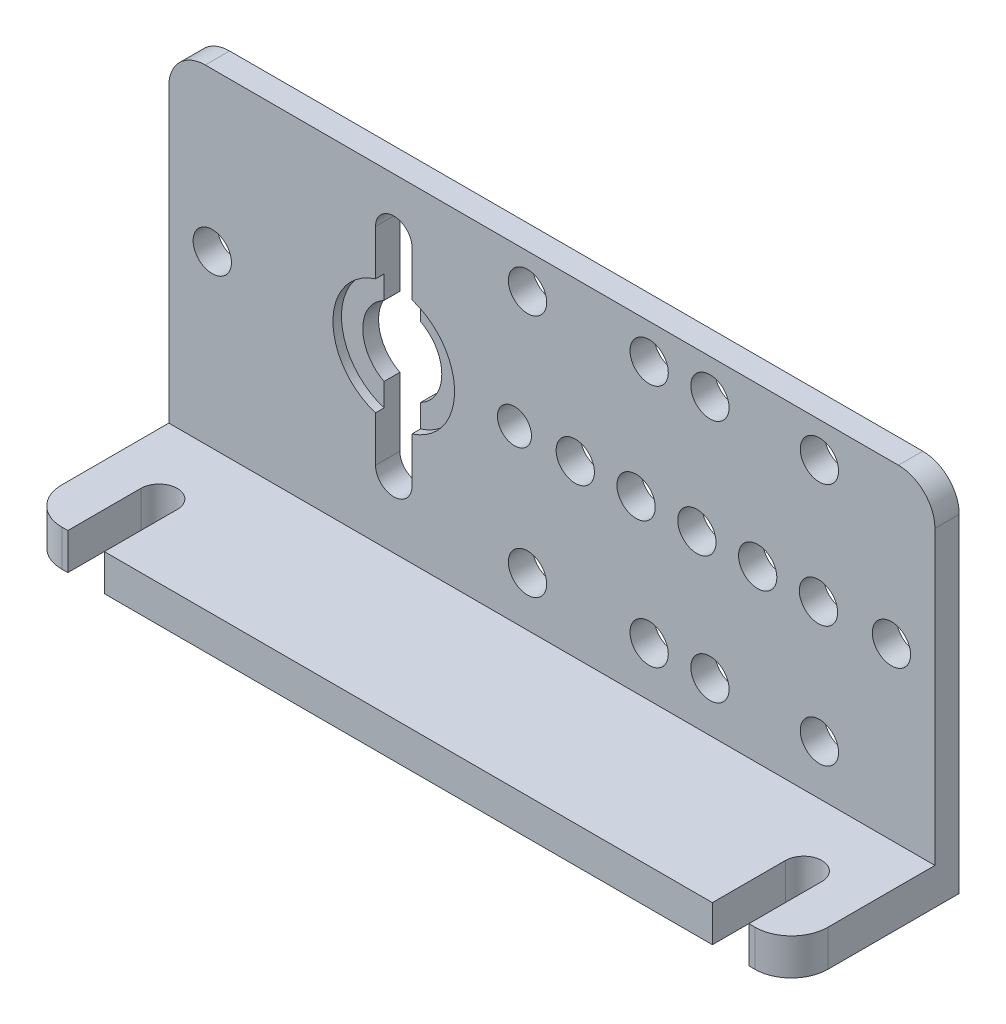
from build123d import *

# Parameters (mm, degrees)
BASE_EXTRUSION_DEPTH    = 2
BOSS_EXTRU_1_DEPTH      = 3
ENL_V_MAT_EXTRU_1_DEPTH = 71.768919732
PER_AGE3_D              = 10
PER_AGE3_DEPTH          = 0.7
ENL_V_MAT_EXTRU_3_DEPTH = 70.917379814
ENL_V_MAT_EXTRU_4_DEPTH = 70.917379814
ESQUISSE18_R            = 1.575
ESQUISSE18_R_2          = 1.4
ENL_V_MAT_EXTRU_5_DEPTH = 71.768919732


with BuildPart() as part:
    # Esquisse1 → Base-Extrusion (new body)
    with BuildSketch(Plane.XY):
        with BuildLine():
            Line((0, 0), (0, 27))
            ThreePointArc((0, 27), (0.878679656, 29.121320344), (3, 30))
            Line((3, 30), (60, 30))
            ThreePointArc((60, 30), (62.121320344, 29.121320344), (63, 27))
            Line((63, 27), (63, 0))
            Line((63, 0), (0, 0))
        make_face()
    extrude(amount=BASE_EXTRUSION_DEPTH)

    # Esquisse2 → Boss.-Extru.1 (add)
    with BuildSketch(Plane(origin=(0, 0, 0), x_dir=(1, 0, 0), z_dir=(0, 1, 0))):
        with BuildLine():
            Line((0, -2), (63, -2))
            Line((63, -2), (63, -10.8))
            ThreePointArc((63, -10.8), (62.121320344, -12.921320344), (60, -13.8))
            Line((60, -13.8), (3, -13.8))
            ThreePointArc((3, -13.8), (0.878679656, -12.921320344), (0, -10.8))
            Line((0, -10.8), (0, -2))
        make_face()
    extrude(amount=BOSS_EXTRU_1_DEPTH)

    # Esquisse5 → Enl_v. mat.-Extru.1 (cut, through all)
    with BuildSketch(Plane.XY.offset(2)):
        with BuildLine():
            Line((17, 25.5), (17, 19.883140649))
            ThreePointArc((17, 19.883140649), (15.25, 17), (17, 14.116859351))
            Line((17, 14.116859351), (17, 8.5))
            ThreePointArc((17, 8.5), (18.5, 7), (20, 8.5))
            Line((20, 8.5), (20, 14.116859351))
            ThreePointArc((20, 14.116859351), (21.75, 17), (20, 19.883140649))
            Line((20, 19.883140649), (20, 25.5))
            ThreePointArc((20, 25.5), (18.5, 27), (17, 25.5))
        make_face()
    extrude(amount=-ENL_V_MAT_EXTRU_1_DEPTH, mode=Mode.SUBTRACT)

    # Per_age3
    with Locations(Plane.XY.offset(2)):
        with Locations((18.5, 17)):
            Hole(PER_AGE3_D / 2, depth=PER_AGE3_DEPTH)

    # Esquisse12 → Enl_v. mat.-Extru.3 (cut, through all)
    with BuildSketch(Plane(origin=(0, 3, 0), x_dir=(-1, 0, 0), z_dir=(0, 1, 0))):
        with BuildLine():
            Line((-3.5, 13.8), (-3.5, 7.8))
            ThreePointArc((-3.5, 7.8), (-5, 6.3), (-6.5, 7.8))
            Line((-6.5, 7.8), (-6.5, 13.8))
            Line((-6.5, 13.8), (-3.5, 13.8))
        make_face()
    extrude(amount=-ENL_V_MAT_EXTRU_3_DEPTH, mode=Mode.SUBTRACT)

    # Esquisse13 → Enl_v. mat.-Extru.4 (cut, through all)
    with BuildSketch(Plane(origin=(0, 3, 0), x_dir=(-1, 0, 0), z_dir=(0, 1, 0))):
        with BuildLine():
            Line((-56.5, 13.8), (-59.5, 13.8))
            Line((-59.5, 13.8), (-59.5, 7.8))
            ThreePointArc((-59.5, 7.8), (-58, 6.3), (-56.5, 7.8))
            Line((-56.5, 7.8), (-56.5, 13.8))
        make_face()
    extrude(amount=-ENL_V_MAT_EXTRU_4_DEPTH, mode=Mode.SUBTRACT)

    # Esquisse18 → Enl_v. mat.-Extru.5 (cut, through all)
    with BuildSketch(Plane.XY.offset(2)):
        with Locations((3.575, 17)):
            Circle(ESQUISSE18_R)
        with Locations((28.425, 17)):
            Circle(ESQUISSE18_R_2)
        with Locations((33.425, 17)):
            Circle(ESQUISSE18_R)
        with Locations((38.425, 17)):
            Circle(ESQUISSE18_R)
        with Locations((43.425, 17)):
            Circle(ESQUISSE18_R)
        with Locations((48.425, 17)):
            Circle(ESQUISSE18_R)
        with Locations((53.425, 17)):
            Circle(ESQUISSE18_R)
        with Locations((44.5, 7.075)):
            Circle(ESQUISSE18_R)
        with Locations((39.5, 7.075)):
            Circle(ESQUISSE18_R)
        with Locations((29.5, 7.075)):
            Circle(ESQUISSE18_R)
        with Locations((29.5, 27.125)):
            Circle(ESQUISSE18_R)
        with Locations((39.5, 27.125)):
            Circle(ESQUISSE18_R)
        with Locations((44.5, 27.125)):
            Circle(ESQUISSE18_R)
        with Locations((59.425, 17)):
            Circle(ESQUISSE18_R)
        with Locations((53.5, 27.125)):
            Circle(ESQUISSE18_R)
        with Locations((53.5, 7.075)):
            Circle(ESQUISSE18_R)
    extrude(amount=-ENL_V_MAT_EXTRU_5_DEPTH, mode=Mode.SUBTRACT)


solid = part.part
